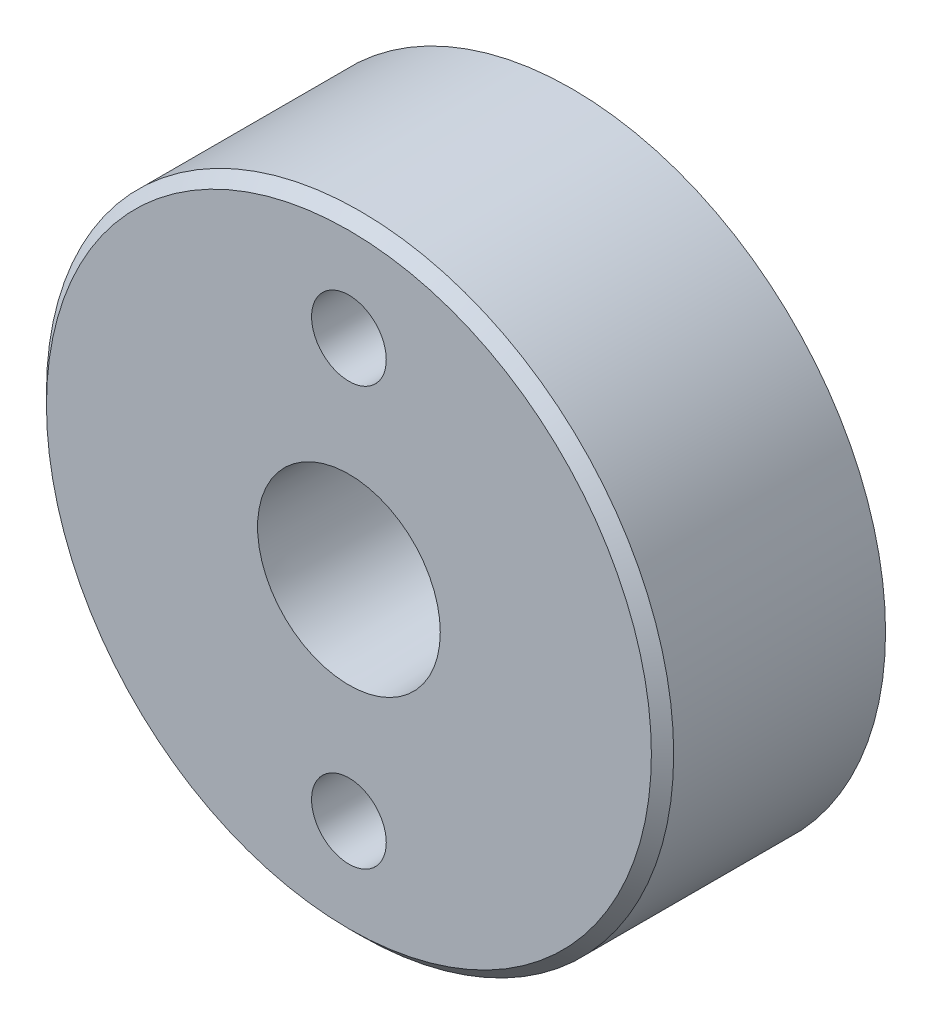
ISO-10303-21;
HEADER;
FILE_DESCRIPTION(('STEP AP214'),'2;1');
FILE_NAME('part.step','',(''),(''),'','','');
FILE_SCHEMA(('AUTOMOTIVE_DESIGN { 1 0 10303 214 1 1 1 1 }'));
ENDSEC;
DATA;
#1=APPLICATION_CONTEXT('core data for automotive mechanical design processes');
#2=APPLICATION_PROTOCOL_DEFINITION('international standard','automotive_design',2000,#1);
#3=PRODUCT_CONTEXT('',#1,'mechanical');
#4=PRODUCT('Part','Part','',(#3));
#5=PRODUCT_RELATED_PRODUCT_CATEGORY('part','',(#4));
#6=PRODUCT_DEFINITION_FORMATION('','',#4);
#7=PRODUCT_DEFINITION_CONTEXT('part definition',#1,'design');
#8=PRODUCT_DEFINITION('design','',#6,#7);
#9=PRODUCT_DEFINITION_SHAPE('','',#8);
#10=(LENGTH_UNIT() NAMED_UNIT(*) SI_UNIT(.MILLI.,.METRE.));
#11=(NAMED_UNIT(*) PLANE_ANGLE_UNIT() SI_UNIT($,.RADIAN.));
#12=(NAMED_UNIT(*) SI_UNIT($,.STERADIAN.) SOLID_ANGLE_UNIT());
#13=UNCERTAINTY_MEASURE_WITH_UNIT(LENGTH_MEASURE(1.E-05),#10,'distance_accuracy_value','');
#14=(GEOMETRIC_REPRESENTATION_CONTEXT(3) GLOBAL_UNCERTAINTY_ASSIGNED_CONTEXT((#13)) GLOBAL_UNIT_ASSIGNED_CONTEXT((#10,
#11,#12)) REPRESENTATION_CONTEXT('',''));
#15=CARTESIAN_POINT('',(0.,0.,0.));
#16=DIRECTION('',(0.,0.,1.));
#17=DIRECTION('',(1.,0.,0.));
#18=AXIS2_PLACEMENT_3D('',#15,#16,#17);
#19=CARTESIAN_POINT('',(0.,0.,7.62));
#20=DIRECTION('',(0.,0.,-1.));
#21=DIRECTION('',(-1.,0.,0.));
#22=AXIS2_PLACEMENT_3D('',#19,#20,#21);
#23=CYLINDRICAL_SURFACE('',#22,21.43125);
#24=CARTESIAN_POINT('',(0.,0.,6.858));
#25=DIRECTION('',(0.,0.,1.));
#26=DIRECTION('',(1.,0.,0.));
#27=AXIS2_PLACEMENT_3D('',#24,#25,#26);
#28=CIRCLE('',#27,21.43125);
#29=CARTESIAN_POINT('',(-21.43125,0.,6.858));
#30=VERTEX_POINT('',#29);
#31=EDGE_CURVE('E11',#30,#30,#28,.F.);
#32=CARTESIAN_POINT('',(0.,0.,-7.62));
#33=DIRECTION('',(0.,0.,1.));
#34=DIRECTION('',(1.,0.,0.));
#35=AXIS2_PLACEMENT_3D('',#32,#33,#34);
#36=CIRCLE('',#35,21.43125);
#37=CARTESIAN_POINT('',(-21.43125,0.,-7.62));
#38=VERTEX_POINT('',#37);
#39=EDGE_CURVE('E79',#38,#38,#36,.T.);
#40=CARTESIAN_POINT('',(-21.43125,0.,6.858));
#41=CARTESIAN_POINT('',(-21.43125,0.,6.7071875));
#42=CARTESIAN_POINT('',(-21.43125,0.,6.556375));
#43=CARTESIAN_POINT('',(-21.43125,0.,6.25475));
#44=CARTESIAN_POINT('',(-21.43125,0.,6.1039375));
#45=CARTESIAN_POINT('',(-21.43125,0.,5.8023125));
#46=CARTESIAN_POINT('',(-21.43125,0.,5.6515));
#47=CARTESIAN_POINT('',(-21.43125,0.,5.349875));
#48=CARTESIAN_POINT('',(-21.43125,0.,5.1990625));
#49=CARTESIAN_POINT('',(-21.43125,0.,4.8974375));
#50=CARTESIAN_POINT('',(-21.43125,0.,4.746625));
#51=CARTESIAN_POINT('',(-21.43125,0.,4.445));
#52=CARTESIAN_POINT('',(-21.43125,0.,4.2941875));
#53=CARTESIAN_POINT('',(-21.43125,0.,3.9925625));
#54=CARTESIAN_POINT('',(-21.43125,0.,3.84175));
#55=CARTESIAN_POINT('',(-21.43125,0.,3.540125));
#56=CARTESIAN_POINT('',(-21.43125,0.,3.3893125));
#57=CARTESIAN_POINT('',(-21.43125,0.,3.0876875));
#58=CARTESIAN_POINT('',(-21.43125,0.,2.936875));
#59=CARTESIAN_POINT('',(-21.43125,0.,2.63525));
#60=CARTESIAN_POINT('',(-21.43125,0.,2.4844375));
#61=CARTESIAN_POINT('',(-21.43125,0.,2.1828125));
#62=CARTESIAN_POINT('',(-21.43125,0.,2.032));
#63=CARTESIAN_POINT('',(-21.43125,0.,1.730375));
#64=CARTESIAN_POINT('',(-21.43125,0.,1.5795625));
#65=CARTESIAN_POINT('',(-21.43125,0.,1.2779375));
#66=CARTESIAN_POINT('',(-21.43125,0.,1.127125));
#67=CARTESIAN_POINT('',(-21.43125,0.,0.8255));
#68=CARTESIAN_POINT('',(-21.43125,0.,0.6746875));
#69=CARTESIAN_POINT('',(-21.43125,0.,0.3730625));
#70=CARTESIAN_POINT('',(-21.43125,0.,0.22225));
#71=CARTESIAN_POINT('',(-21.43125,0.,-0.0793749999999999));
#72=CARTESIAN_POINT('',(-21.43125,0.,-0.230187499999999));
#73=CARTESIAN_POINT('',(-21.43125,0.,-0.531812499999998));
#74=CARTESIAN_POINT('',(-21.43125,0.,-0.682624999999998));
#75=CARTESIAN_POINT('',(-21.43125,0.,-0.984249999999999));
#76=CARTESIAN_POINT('',(-21.43125,0.,-1.1350625));
#77=CARTESIAN_POINT('',(-21.43125,0.,-1.4366875));
#78=CARTESIAN_POINT('',(-21.43125,0.,-1.5875));
#79=CARTESIAN_POINT('',(-21.43125,0.,-1.889125));
#80=CARTESIAN_POINT('',(-21.43125,0.,-2.0399375));
#81=CARTESIAN_POINT('',(-21.43125,0.,-2.3415625));
#82=CARTESIAN_POINT('',(-21.43125,0.,-2.492375));
#83=CARTESIAN_POINT('',(-21.43125,0.,-2.794));
#84=CARTESIAN_POINT('',(-21.43125,0.,-2.9448125));
#85=CARTESIAN_POINT('',(-21.43125,0.,-3.2464375));
#86=CARTESIAN_POINT('',(-21.43125,0.,-3.39725));
#87=CARTESIAN_POINT('',(-21.43125,0.,-3.698875));
#88=CARTESIAN_POINT('',(-21.43125,0.,-3.8496875));
#89=CARTESIAN_POINT('',(-21.43125,0.,-4.1513125));
#90=CARTESIAN_POINT('',(-21.43125,0.,-4.302125));
#91=CARTESIAN_POINT('',(-21.43125,0.,-4.60375));
#92=CARTESIAN_POINT('',(-21.43125,0.,-4.7545625));
#93=CARTESIAN_POINT('',(-21.43125,0.,-5.0561875));
#94=CARTESIAN_POINT('',(-21.43125,0.,-5.207));
#95=CARTESIAN_POINT('',(-21.43125,0.,-5.508625));
#96=CARTESIAN_POINT('',(-21.43125,0.,-5.6594375));
#97=CARTESIAN_POINT('',(-21.43125,0.,-5.9610625));
#98=CARTESIAN_POINT('',(-21.43125,0.,-6.111875));
#99=CARTESIAN_POINT('',(-21.43125,0.,-6.4135));
#100=CARTESIAN_POINT('',(-21.43125,0.,-6.5643125));
#101=CARTESIAN_POINT('',(-21.43125,0.,-6.8659375));
#102=CARTESIAN_POINT('',(-21.43125,0.,-7.01675));
#103=CARTESIAN_POINT('',(-21.43125,0.,-7.318375));
#104=CARTESIAN_POINT('',(-21.43125,0.,-7.4691875));
#105=CARTESIAN_POINT('',(-21.43125,0.,-7.62));
#106=B_SPLINE_CURVE_WITH_KNOTS('',3,(#40,#41,#42,#43,#44,#45,#46,#47,#48,#49,#50,#51,#52,#53,
#54,#55,#56,#57,#58,#59,#60,#61,#62,#63,#64,#65,#66,#67,#68,#69,#70,#71,#72,#73,#74,#75,#76,#77,
#78,#79,#80,#81,#82,#83,#84,#85,#86,#87,#88,#89,#90,#91,#92,#93,#94,#95,#96,#97,#98,#99,#100,
#101,#102,#103,#104,#105),.UNSPECIFIED.,.F.,.F.,(4,2,2,2,2,2,2,2,2,2,2,2,2,2,2,2,2,2,2,2,2,2,2,
2,2,2,2,2,2,2,2,2,4),(0.,0.4524375,0.904874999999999,1.3573125,1.80975,2.2621875,2.714625,
3.1670625,3.6195,4.0719375,4.524375,4.9768125,5.42925,5.8816875,6.334125,6.7865625,7.239,
7.6914375,8.143875,8.5963125,9.04875,9.5011875,9.953625,10.4060625,10.8585,11.3109375,11.763375,
12.2158125,12.66825,13.1206875,13.573125,14.0255625,14.478),.UNSPECIFIED.);
#107=EDGE_CURVE('BSEAM35',#30,#38,#106,.T.);
#108=ORIENTED_EDGE('',*,*,#31,.T.);
#109=ORIENTED_EDGE('',*,*,#39,.T.);
#110=ORIENTED_EDGE('',*,*,#107,.T.);
#111=ORIENTED_EDGE('',*,*,#107,.F.);
#112=EDGE_LOOP('',(#108,#110,#109,#111));
#113=FACE_BOUND('',#112,.T.);
#114=ADVANCED_FACE('F35',(#113),#23,.T.);
#115=CARTESIAN_POINT('',(0.,0.,7.62));
#116=DIRECTION('',(0.,0.,1.));
#117=DIRECTION('',(1.,0.,0.));
#118=AXIS2_PLACEMENT_3D('',#115,#116,#117);
#119=PLANE('',#118);
#120=CARTESIAN_POINT('',(0.,0.,7.62));
#121=DIRECTION('',(0.,0.,1.));
#122=DIRECTION('',(1.,0.,0.));
#123=AXIS2_PLACEMENT_3D('',#120,#121,#122);
#124=CIRCLE('',#123,20.66925);
#125=CARTESIAN_POINT('',(20.66925,0.,7.62));
#126=VERTEX_POINT('',#125);
#127=EDGE_CURVE('E43',#126,#126,#124,.T.);
#128=ORIENTED_EDGE('',*,*,#127,.T.);
#129=EDGE_LOOP('',(#128));
#130=FACE_BOUND('',#129,.T.);
#131=CARTESIAN_POINT('',(0.,-14.2875,7.62));
#132=DIRECTION('',(0.,0.,1.));
#133=DIRECTION('',(1.,0.,0.));
#134=AXIS2_PLACEMENT_3D('',#131,#132,#133);
#135=CIRCLE('',#134,2.5527);
#136=CARTESIAN_POINT('',(2.5526999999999,-14.2875,7.62));
#137=VERTEX_POINT('',#136);
#138=EDGE_CURVE('E58',#137,#137,#135,.T.);
#139=ORIENTED_EDGE('',*,*,#138,.F.);
#140=EDGE_LOOP('',(#139));
#141=FACE_BOUND('',#140,.T.);
#142=CARTESIAN_POINT('',(0.,14.2875,7.62));
#143=DIRECTION('',(0.,0.,1.));
#144=DIRECTION('',(1.,0.,0.));
#145=AXIS2_PLACEMENT_3D('',#142,#143,#144);
#146=CIRCLE('',#145,2.5527);
#147=CARTESIAN_POINT('',(2.5527,14.2875,7.62));
#148=VERTEX_POINT('',#147);
#149=EDGE_CURVE('E66',#148,#148,#146,.T.);
#150=ORIENTED_EDGE('',*,*,#149,.F.);
#151=EDGE_LOOP('',(#150));
#152=FACE_BOUND('',#151,.T.);
#153=CARTESIAN_POINT('',(0.,0.,7.62));
#154=DIRECTION('',(0.,0.,1.));
#155=DIRECTION('',(1.,0.,0.));
#156=AXIS2_PLACEMENT_3D('',#153,#154,#155);
#157=CIRCLE('',#156,6.243701);
#158=CARTESIAN_POINT('',(6.243701,0.,7.62));
#159=VERTEX_POINT('',#158);
#160=EDGE_CURVE('E69',#159,#159,#157,.T.);
#161=ORIENTED_EDGE('',*,*,#160,.F.);
#162=EDGE_LOOP('',(#161));
#163=FACE_BOUND('',#162,.T.);
#164=ADVANCED_FACE('F86',(#130,#141,#152,#163),#119,.T.);
#165=CARTESIAN_POINT('',(0.,0.,-7.62));
#166=DIRECTION('',(0.,0.,1.));
#167=DIRECTION('',(1.,0.,0.));
#168=AXIS2_PLACEMENT_3D('',#165,#166,#167);
#169=PLANE('',#168);
#170=CARTESIAN_POINT('',(0.,0.,-7.62));
#171=DIRECTION('',(0.,0.,1.));
#172=DIRECTION('',(1.,0.,0.));
#173=AXIS2_PLACEMENT_3D('',#170,#171,#172);
#174=CIRCLE('',#173,5.5626);
#175=CARTESIAN_POINT('',(5.5626,0.,-7.62));
#176=VERTEX_POINT('',#175);
#177=EDGE_CURVE('E78',#176,#176,#174,.T.);
#178=ORIENTED_EDGE('',*,*,#177,.T.);
#179=EDGE_LOOP('',(#178));
#180=FACE_BOUND('',#179,.T.);
#181=ORIENTED_EDGE('',*,*,#39,.F.);
#182=EDGE_LOOP('',(#181));
#183=FACE_BOUND('',#182,.T.);
#184=ADVANCED_FACE('F99',(#180,#183),#169,.F.);
#185=CARTESIAN_POINT('',(0.,0.,7.62));
#186=DIRECTION('',(0.,0.,1.));
#187=DIRECTION('',(1.,0.,0.));
#188=AXIS2_PLACEMENT_3D('',#185,#186,#187);
#189=CYLINDRICAL_SURFACE('',#188,5.5626);
#190=CARTESIAN_POINT('',(0.,0.,-2.4003));
#191=DIRECTION('',(0.,0.,1.));
#192=DIRECTION('',(1.,0.,0.));
#193=AXIS2_PLACEMENT_3D('',#190,#191,#192);
#194=CIRCLE('',#193,5.5626);
#195=CARTESIAN_POINT('',(5.5626,0.,-2.4003));
#196=VERTEX_POINT('',#195);
#197=EDGE_CURVE('E75',#196,#196,#194,.T.);
#198=ORIENTED_EDGE('',*,*,#197,.T.);
#199=EDGE_LOOP('',(#198));
#200=FACE_BOUND('',#199,.T.);
#201=ORIENTED_EDGE('',*,*,#177,.F.);
#202=EDGE_LOOP('',(#201));
#203=FACE_BOUND('',#202,.T.);
#204=ADVANCED_FACE('F104',(#200,#203),#189,.F.);
#205=CARTESIAN_POINT('',(5.5626,0.,-2.4003));
#206=DIRECTION('',(0.,0.,-1.));
#207=DIRECTION('',(-1.,0.,0.));
#208=AXIS2_PLACEMENT_3D('',#205,#206,#207);
#209=PLANE('',#208);
#210=ORIENTED_EDGE('',*,*,#197,.F.);
#211=EDGE_LOOP('',(#210));
#212=FACE_BOUND('',#211,.T.);
#213=CARTESIAN_POINT('',(0.,0.,-2.4003));
#214=DIRECTION('',(0.,0.,1.));
#215=DIRECTION('',(1.,0.,0.));
#216=AXIS2_PLACEMENT_3D('',#213,#214,#215);
#217=CIRCLE('',#216,5.94367979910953);
#218=CARTESIAN_POINT('',(5.94367979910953,0.,-2.4003));
#219=VERTEX_POINT('',#218);
#220=EDGE_CURVE('E72',#219,#219,#217,.T.);
#221=ORIENTED_EDGE('',*,*,#220,.T.);
#222=EDGE_LOOP('',(#221));
#223=FACE_BOUND('',#222,.T.);
#224=ADVANCED_FACE('F109',(#212,#223),#209,.F.);
#225=CARTESIAN_POINT('',(0.,0.,7.62));
#226=DIRECTION('',(0.,0.,1.));
#227=DIRECTION('',(1.,0.,0.));
#228=AXIS2_PLACEMENT_3D('',#225,#226,#227);
#229=CONICAL_SURFACE('',#228,6.243701,0.029932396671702);
#230=ORIENTED_EDGE('',*,*,#220,.F.);
#231=EDGE_LOOP('',(#230));
#232=FACE_BOUND('',#231,.T.);
#233=ORIENTED_EDGE('',*,*,#160,.T.);
#234=EDGE_LOOP('',(#233));
#235=FACE_BOUND('',#234,.T.);
#236=ADVANCED_FACE('F113',(#232,#235),#229,.F.);
#237=CARTESIAN_POINT('',(0.,14.2875,7.62));
#238=DIRECTION('',(0.,0.,1.));
#239=DIRECTION('',(1.,0.,0.));
#240=AXIS2_PLACEMENT_3D('',#237,#238,#239);
#241=CYLINDRICAL_SURFACE('',#240,2.5527);
#242=CARTESIAN_POINT('',(0.,14.2875,0.));
#243=DIRECTION('',(0.,0.,1.));
#244=DIRECTION('',(1.,0.,0.));
#245=AXIS2_PLACEMENT_3D('',#242,#243,#244);
#246=CIRCLE('',#245,2.5527);
#247=CARTESIAN_POINT('',(2.5527,14.2875,0.));
#248=VERTEX_POINT('',#247);
#249=EDGE_CURVE('E61',#248,#248,#246,.T.);
#250=ORIENTED_EDGE('',*,*,#249,.F.);
#251=EDGE_LOOP('',(#250));
#252=FACE_BOUND('',#251,.T.);
#253=ORIENTED_EDGE('',*,*,#149,.T.);
#254=EDGE_LOOP('',(#253));
#255=FACE_BOUND('',#254,.T.);
#256=ADVANCED_FACE('F117',(#252,#255),#241,.F.);
#257=CARTESIAN_POINT('',(0.,14.2875,0.));
#258=DIRECTION('',(0.,0.,1.));
#259=DIRECTION('',(1.,0.,0.));
#260=AXIS2_PLACEMENT_3D('',#257,#258,#259);
#261=CONICAL_SURFACE('',#260,2.5527,1.02974425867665);
#262=CARTESIAN_POINT('',(0.,14.2875,-1.53381690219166));
#263=VERTEX_POINT('',#262);
#264=VERTEX_LOOP('',#263);
#265=FACE_BOUND('',#264,.T.);
#266=ORIENTED_EDGE('',*,*,#249,.T.);
#267=EDGE_LOOP('',(#266));
#268=FACE_BOUND('',#267,.T.);
#269=ADVANCED_FACE('F121',(#265,#268),#261,.F.);
#270=CARTESIAN_POINT('',(0.,-14.2875,7.62));
#271=DIRECTION('',(0.,0.,1.));
#272=DIRECTION('',(1.,0.,0.));
#273=AXIS2_PLACEMENT_3D('',#270,#271,#272);
#274=CYLINDRICAL_SURFACE('',#273,2.5527);
#275=CARTESIAN_POINT('',(0.,-14.2875,0.));
#276=DIRECTION('',(0.,0.,1.));
#277=DIRECTION('',(1.,0.,0.));
#278=AXIS2_PLACEMENT_3D('',#275,#276,#277);
#279=CIRCLE('',#278,2.5527);
#280=CARTESIAN_POINT('',(2.5526999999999,-14.2875,0.));
#281=VERTEX_POINT('',#280);
#282=EDGE_CURVE('E56',#281,#281,#279,.T.);
#283=ORIENTED_EDGE('',*,*,#282,.F.);
#284=EDGE_LOOP('',(#283));
#285=FACE_BOUND('',#284,.T.);
#286=ORIENTED_EDGE('',*,*,#138,.T.);
#287=EDGE_LOOP('',(#286));
#288=FACE_BOUND('',#287,.T.);
#289=ADVANCED_FACE('F52',(#285,#288),#274,.F.);
#290=CARTESIAN_POINT('',(0.,-14.2875,0.));
#291=DIRECTION('',(0.,0.,1.));
#292=DIRECTION('',(1.,0.,0.));
#293=AXIS2_PLACEMENT_3D('',#290,#291,#292);
#294=CONICAL_SURFACE('',#293,2.5527,1.02974425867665);
#295=CARTESIAN_POINT('',(-1.02032399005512E-13,-14.2875,-1.53381690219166));
#296=VERTEX_POINT('',#295);
#297=VERTEX_LOOP('',#296);
#298=FACE_BOUND('',#297,.T.);
#299=ORIENTED_EDGE('',*,*,#282,.T.);
#300=EDGE_LOOP('',(#299));
#301=FACE_BOUND('',#300,.T.);
#302=ADVANCED_FACE('F49',(#298,#301),#294,.F.);
#303=CARTESIAN_POINT('',(0.,0.,7.62));
#304=DIRECTION('',(0.,0.,-1.));
#305=DIRECTION('',(-1.,0.,0.));
#306=AXIS2_PLACEMENT_3D('',#303,#304,#305);
#307=CONICAL_SURFACE('',#306,20.66925,0.785398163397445);
#308=ORIENTED_EDGE('',*,*,#31,.F.);
#309=EDGE_LOOP('',(#308));
#310=FACE_BOUND('',#309,.T.);
#311=ORIENTED_EDGE('',*,*,#127,.F.);
#312=EDGE_LOOP('',(#311));
#313=FACE_BOUND('',#312,.T.);
#314=ADVANCED_FACE('F37',(#310,#313),#307,.T.);
#315=CLOSED_SHELL('',(#114,#164,#184,#204,#224,#236,#256,#269,#289,#302,#314));
#316=MANIFOLD_SOLID_BREP('B2',#315);
#317=ADVANCED_BREP_SHAPE_REPRESENTATION('',(#18,#316),#14);
#318=SHAPE_DEFINITION_REPRESENTATION(#9,#317);
ENDSEC;
END-ISO-10303-21;
